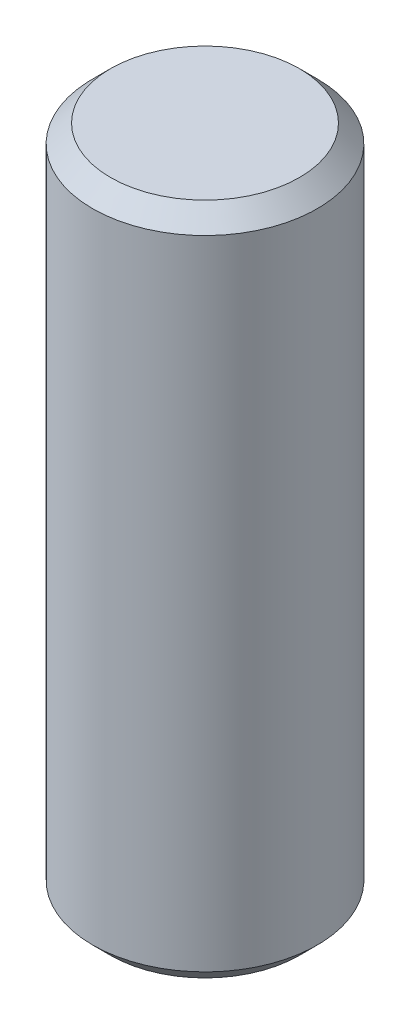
from build123d import *

# Parameters (mm, degrees)
SKETCH1_R      = 3.17754
EXTRUDE1_DEPTH = 9.525
CHAMFER1_SIZE  = 0.508


with BuildPart() as part:
    # Sketch1 → Extrude1 (new, symmetric)
    with BuildSketch(Plane(origin=(0, 0, 0), x_dir=(1, 0, 0), z_dir=(0, 1, 0))):
        with Locations(Location((0, 0, 0), (0, 0, 90))):
            Circle(SKETCH1_R)
    extrude(amount=EXTRUDE1_DEPTH, both=True)

    # Chamfer1
    chamfer1_edges = [part.edges().sort_by_distance(p)[0] for p in [
        (0, -9.525, 3.17754),
        (0, 9.525, 3.17754),
    ]]
    chamfer(chamfer1_edges, length=CHAMFER1_SIZE)


solid = part.part
